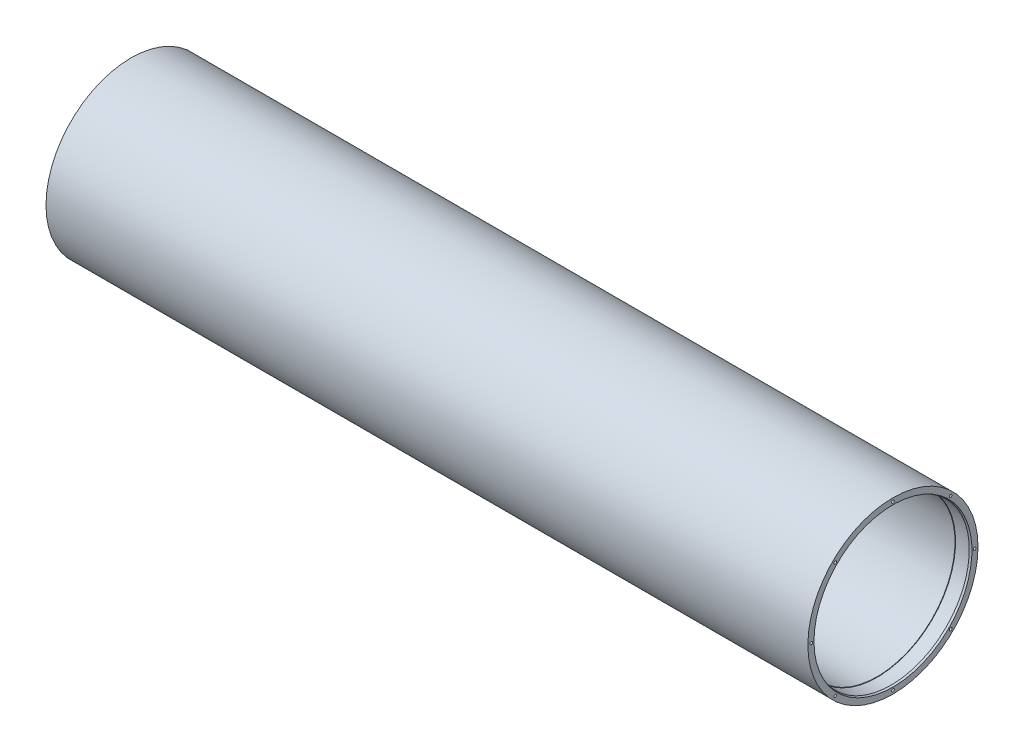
ISO-10303-21;
HEADER;
FILE_DESCRIPTION(('STEP AP214'),'2;1');
FILE_NAME('part.step','',(''),(''),'','','');
FILE_SCHEMA(('AUTOMOTIVE_DESIGN { 1 0 10303 214 1 1 1 1 }'));
ENDSEC;
DATA;
#1=APPLICATION_CONTEXT('core data for automotive mechanical design processes');
#2=APPLICATION_PROTOCOL_DEFINITION('international standard','automotive_design',2000,#1);
#3=PRODUCT_CONTEXT('',#1,'mechanical');
#4=PRODUCT('Part','Part','',(#3));
#5=PRODUCT_RELATED_PRODUCT_CATEGORY('part','',(#4));
#6=PRODUCT_DEFINITION_FORMATION('','',#4);
#7=PRODUCT_DEFINITION_CONTEXT('part definition',#1,'design');
#8=PRODUCT_DEFINITION('design','',#6,#7);
#9=PRODUCT_DEFINITION_SHAPE('','',#8);
#10=(LENGTH_UNIT() NAMED_UNIT(*) SI_UNIT(.MILLI.,.METRE.));
#11=(NAMED_UNIT(*) PLANE_ANGLE_UNIT() SI_UNIT($,.RADIAN.));
#12=(NAMED_UNIT(*) SI_UNIT($,.STERADIAN.) SOLID_ANGLE_UNIT());
#13=UNCERTAINTY_MEASURE_WITH_UNIT(LENGTH_MEASURE(1.E-05),#10,'distance_accuracy_value','');
#14=(GEOMETRIC_REPRESENTATION_CONTEXT(3) GLOBAL_UNCERTAINTY_ASSIGNED_CONTEXT((#13)) GLOBAL_UNIT_ASSIGNED_CONTEXT((#10,
#11,#12)) REPRESENTATION_CONTEXT('',''));
#15=CARTESIAN_POINT('',(0.,0.,0.));
#16=DIRECTION('',(0.,0.,1.));
#17=DIRECTION('',(1.,0.,0.));
#18=AXIS2_PLACEMENT_3D('',#15,#16,#17);
#19=CARTESIAN_POINT('',(4.67565707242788,0.,0.));
#20=DIRECTION('',(-1.,0.,0.));
#21=DIRECTION('',(0.,0.,1.));
#22=AXIS2_PLACEMENT_3D('',#19,#20,#21);
#23=CONICAL_SURFACE('',#22,190.5,0.349065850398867);
#24=CARTESIAN_POINT('',(0.,0.,0.));
#25=DIRECTION('',(-1.,0.,0.));
#26=DIRECTION('',(0.,0.,1.));
#27=AXIS2_PLACEMENT_3D('',#24,#25,#26);
#28=CIRCLE('',#27,192.2018);
#29=CARTESIAN_POINT('',(0.,0.,192.2018));
#30=VERTEX_POINT('',#29);
#31=EDGE_CURVE('E540',#30,#30,#28,.T.);
#32=ORIENTED_EDGE('',*,*,#31,.T.);
#33=EDGE_LOOP('',(#32));
#34=FACE_BOUND('',#33,.T.);
#35=CARTESIAN_POINT('',(4.67565707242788,0.,0.));
#36=DIRECTION('',(-1.,0.,0.));
#37=DIRECTION('',(0.,0.,1.));
#38=AXIS2_PLACEMENT_3D('',#35,#36,#37);
#39=CIRCLE('',#38,190.5);
#40=CARTESIAN_POINT('',(4.67565707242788,0.,190.5));
#41=VERTEX_POINT('',#40);
#42=EDGE_CURVE('E11',#41,#41,#39,.T.);
#43=ORIENTED_EDGE('',*,*,#42,.F.);
#44=EDGE_LOOP('',(#43));
#45=FACE_BOUND('',#44,.T.);
#46=ADVANCED_FACE('F380',(#34,#45),#23,.F.);
#47=CARTESIAN_POINT('',(0.,0.,0.));
#48=DIRECTION('',(-1.,0.,0.));
#49=DIRECTION('',(0.,0.,1.));
#50=AXIS2_PLACEMENT_3D('',#47,#48,#49);
#51=CYLINDRICAL_SURFACE('',#50,190.5);
#52=ORIENTED_EDGE('',*,*,#42,.T.);
#53=EDGE_LOOP('',(#52));
#54=FACE_BOUND('',#53,.T.);
#55=CARTESIAN_POINT('',(38.1,0.,0.));
#56=DIRECTION('',(-1.,0.,0.));
#57=DIRECTION('',(0.,0.,1.));
#58=AXIS2_PLACEMENT_3D('',#55,#56,#57);
#59=CIRCLE('',#58,190.5);
#60=CARTESIAN_POINT('',(38.1,0.,190.5));
#61=VERTEX_POINT('',#60);
#62=EDGE_CURVE('E387',#61,#61,#59,.T.);
#63=ORIENTED_EDGE('',*,*,#62,.F.);
#64=EDGE_LOOP('',(#63));
#65=FACE_BOUND('',#64,.T.);
#66=ADVANCED_FACE('F569',(#54,#65),#51,.F.);
#67=CARTESIAN_POINT('',(38.7350000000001,0.,0.));
#68=DIRECTION('',(-1.,0.,0.));
#69=DIRECTION('',(0.,0.,1.));
#70=AXIS2_PLACEMENT_3D('',#67,#68,#69);
#71=CONICAL_SURFACE('',#70,189.865,0.785398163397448);
#72=ORIENTED_EDGE('',*,*,#62,.T.);
#73=EDGE_LOOP('',(#72));
#74=FACE_BOUND('',#73,.T.);
#75=CARTESIAN_POINT('',(38.7350000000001,0.,0.));
#76=DIRECTION('',(-1.,0.,0.));
#77=DIRECTION('',(0.,0.,1.));
#78=AXIS2_PLACEMENT_3D('',#75,#76,#77);
#79=CIRCLE('',#78,189.865);
#80=CARTESIAN_POINT('',(38.7350000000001,0.,189.865));
#81=VERTEX_POINT('',#80);
#82=EDGE_CURVE('E561',#81,#81,#79,.T.);
#83=ORIENTED_EDGE('',*,*,#82,.F.);
#84=EDGE_LOOP('',(#83));
#85=FACE_BOUND('',#84,.T.);
#86=ADVANCED_FACE('F566',(#74,#85),#71,.F.);
#87=CARTESIAN_POINT('',(0.,0.,0.));
#88=DIRECTION('',(-1.,0.,0.));
#89=DIRECTION('',(0.,0.,1.));
#90=AXIS2_PLACEMENT_3D('',#87,#88,#89);
#91=CYLINDRICAL_SURFACE('',#90,189.865);
#92=ORIENTED_EDGE('',*,*,#82,.T.);
#93=EDGE_LOOP('',(#92));
#94=FACE_BOUND('',#93,.T.);
#95=CARTESIAN_POINT('',(1815.465,0.,0.));
#96=DIRECTION('',(-1.,0.,0.));
#97=DIRECTION('',(0.,0.,1.));
#98=AXIS2_PLACEMENT_3D('',#95,#96,#97);
#99=CIRCLE('',#98,189.865);
#100=CARTESIAN_POINT('',(1815.465,0.,189.865));
#101=VERTEX_POINT('',#100);
#102=EDGE_CURVE('E558',#101,#101,#99,.T.);
#103=ORIENTED_EDGE('',*,*,#102,.F.);
#104=EDGE_LOOP('',(#103));
#105=FACE_BOUND('',#104,.T.);
#106=ADVANCED_FACE('F576',(#94,#105),#91,.F.);
#107=CARTESIAN_POINT('',(1816.1,0.,0.));
#108=DIRECTION('',(1.,0.,0.));
#109=DIRECTION('',(0.,0.,-1.));
#110=AXIS2_PLACEMENT_3D('',#107,#108,#109);
#111=CONICAL_SURFACE('',#110,190.5,0.785398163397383);
#112=ORIENTED_EDGE('',*,*,#102,.T.);
#113=EDGE_LOOP('',(#112));
#114=FACE_BOUND('',#113,.T.);
#115=CARTESIAN_POINT('',(1816.1,0.,0.));
#116=DIRECTION('',(-1.,0.,0.));
#117=DIRECTION('',(0.,0.,1.));
#118=AXIS2_PLACEMENT_3D('',#115,#116,#117);
#119=CIRCLE('',#118,190.5);
#120=CARTESIAN_POINT('',(1816.1,0.,190.5));
#121=VERTEX_POINT('',#120);
#122=EDGE_CURVE('E555',#121,#121,#119,.T.);
#123=ORIENTED_EDGE('',*,*,#122,.F.);
#124=EDGE_LOOP('',(#123));
#125=FACE_BOUND('',#124,.T.);
#126=ADVANCED_FACE('F582',(#114,#125),#111,.F.);
#127=CARTESIAN_POINT('',(0.,0.,0.));
#128=DIRECTION('',(-1.,0.,0.));
#129=DIRECTION('',(0.,0.,1.));
#130=AXIS2_PLACEMENT_3D('',#127,#128,#129);
#131=CYLINDRICAL_SURFACE('',#130,190.5);
#132=ORIENTED_EDGE('',*,*,#122,.T.);
#133=EDGE_LOOP('',(#132));
#134=FACE_BOUND('',#133,.T.);
#135=CARTESIAN_POINT('',(1849.52434292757,0.,0.));
#136=DIRECTION('',(-1.,0.,0.));
#137=DIRECTION('',(0.,0.,1.));
#138=AXIS2_PLACEMENT_3D('',#135,#136,#137);
#139=CIRCLE('',#138,190.5);
#140=CARTESIAN_POINT('',(1849.52434292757,0.,190.5));
#141=VERTEX_POINT('',#140);
#142=EDGE_CURVE('E552',#141,#141,#139,.T.);
#143=ORIENTED_EDGE('',*,*,#142,.F.);
#144=EDGE_LOOP('',(#143));
#145=FACE_BOUND('',#144,.T.);
#146=ADVANCED_FACE('F586',(#134,#145),#131,.F.);
#147=CARTESIAN_POINT('',(1854.2,0.,0.));
#148=DIRECTION('',(1.,0.,0.));
#149=DIRECTION('',(0.,0.,-1.));
#150=AXIS2_PLACEMENT_3D('',#147,#148,#149);
#151=CONICAL_SURFACE('',#150,192.2018,0.349065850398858);
#152=ORIENTED_EDGE('',*,*,#142,.T.);
#153=EDGE_LOOP('',(#152));
#154=FACE_BOUND('',#153,.T.);
#155=CARTESIAN_POINT('',(1854.2,0.,0.));
#156=DIRECTION('',(-1.,0.,0.));
#157=DIRECTION('',(0.,0.,1.));
#158=AXIS2_PLACEMENT_3D('',#155,#156,#157);
#159=CIRCLE('',#158,192.2018);
#160=CARTESIAN_POINT('',(1854.2,0.,192.2018));
#161=VERTEX_POINT('',#160);
#162=EDGE_CURVE('E549',#161,#161,#159,.T.);
#163=ORIENTED_EDGE('',*,*,#162,.F.);
#164=EDGE_LOOP('',(#163));
#165=FACE_BOUND('',#164,.T.);
#166=ADVANCED_FACE('F590',(#154,#165),#151,.F.);
#167=CARTESIAN_POINT('',(1854.2,-192.2018,0.));
#168=DIRECTION('',(1.,0.,0.));
#169=DIRECTION('',(0.,0.,-1.));
#170=AXIS2_PLACEMENT_3D('',#167,#168,#169);
#171=PLANE('',#170);
#172=CARTESIAN_POINT('',(1854.2,140.541008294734,-140.541008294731));
#173=DIRECTION('',(1.,0.,0.));
#174=DIRECTION('',(0.,0.,-1.));
#175=AXIS2_PLACEMENT_3D('',#172,#173,#174);
#176=CIRCLE('',#175,3.26389999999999);
#177=CARTESIAN_POINT('',(1854.2,140.541008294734,-143.804908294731));
#178=VERTEX_POINT('',#177);
#179=EDGE_CURVE('E445',#178,#178,#176,.T.);
#180=ORIENTED_EDGE('',*,*,#179,.F.);
#181=EDGE_LOOP('',(#180));
#182=FACE_BOUND('',#181,.T.);
#183=CARTESIAN_POINT('',(1854.2,2.08184932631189E-12,-198.755));
#184=DIRECTION('',(1.,0.,0.));
#185=DIRECTION('',(0.,0.,-1.));
#186=AXIS2_PLACEMENT_3D('',#183,#184,#185);
#187=CIRCLE('',#186,3.2639);
#188=CARTESIAN_POINT('',(1854.2,2.08184932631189E-12,-202.0189));
#189=VERTEX_POINT('',#188);
#190=EDGE_CURVE('E453',#189,#189,#187,.T.);
#191=ORIENTED_EDGE('',*,*,#190,.F.);
#192=EDGE_LOOP('',(#191));
#193=FACE_BOUND('',#192,.T.);
#194=CARTESIAN_POINT('',(1854.2,-140.541008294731,-140.541008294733));
#195=DIRECTION('',(1.,0.,0.));
#196=DIRECTION('',(0.,0.,-1.));
#197=AXIS2_PLACEMENT_3D('',#194,#195,#196);
#198=CIRCLE('',#197,3.26389999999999);
#199=CARTESIAN_POINT('',(1854.2,-140.541008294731,-143.804908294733));
#200=VERTEX_POINT('',#199);
#201=EDGE_CURVE('E459',#200,#200,#198,.T.);
#202=ORIENTED_EDGE('',*,*,#201,.F.);
#203=EDGE_LOOP('',(#202));
#204=FACE_BOUND('',#203,.T.);
#205=CARTESIAN_POINT('',(1854.2,-198.755,-1.38789955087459E-12));
#206=DIRECTION('',(1.,0.,0.));
#207=DIRECTION('',(0.,0.,-1.));
#208=AXIS2_PLACEMENT_3D('',#205,#206,#207);
#209=CIRCLE('',#208,3.26389999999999);
#210=CARTESIAN_POINT('',(1854.2,-198.755,-3.26390000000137));
#211=VERTEX_POINT('',#210);
#212=EDGE_CURVE('E465',#211,#211,#209,.T.);
#213=ORIENTED_EDGE('',*,*,#212,.F.);
#214=EDGE_LOOP('',(#213));
#215=FACE_BOUND('',#214,.T.);
#216=CARTESIAN_POINT('',(1854.2,-140.541008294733,140.541008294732));
#217=DIRECTION('',(1.,0.,0.));
#218=DIRECTION('',(0.,0.,-1.));
#219=AXIS2_PLACEMENT_3D('',#216,#217,#218);
#220=CIRCLE('',#219,3.26389999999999);
#221=CARTESIAN_POINT('',(1854.2,-140.541008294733,137.277108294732));
#222=VERTEX_POINT('',#221);
#223=EDGE_CURVE('E471',#222,#222,#220,.T.);
#224=ORIENTED_EDGE('',*,*,#223,.F.);
#225=EDGE_LOOP('',(#224));
#226=FACE_BOUND('',#225,.T.);
#227=CARTESIAN_POINT('',(1854.2,-6.93949775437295E-13,198.755));
#228=DIRECTION('',(1.,0.,0.));
#229=DIRECTION('',(0.,0.,-1.));
#230=AXIS2_PLACEMENT_3D('',#227,#228,#229);
#231=CIRCLE('',#230,3.2639);
#232=CARTESIAN_POINT('',(1854.2,-6.93949775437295E-13,195.4911));
#233=VERTEX_POINT('',#232);
#234=EDGE_CURVE('E477',#233,#233,#231,.T.);
#235=ORIENTED_EDGE('',*,*,#234,.F.);
#236=EDGE_LOOP('',(#235));
#237=FACE_BOUND('',#236,.T.);
#238=CARTESIAN_POINT('',(1854.2,140.541008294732,140.541008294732));
#239=DIRECTION('',(1.,0.,0.));
#240=DIRECTION('',(0.,0.,-1.));
#241=AXIS2_PLACEMENT_3D('',#238,#239,#240);
#242=CIRCLE('',#241,3.26389999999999);
#243=CARTESIAN_POINT('',(1854.2,140.541008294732,137.277108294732));
#244=VERTEX_POINT('',#243);
#245=EDGE_CURVE('E483',#244,#244,#242,.T.);
#246=ORIENTED_EDGE('',*,*,#245,.F.);
#247=EDGE_LOOP('',(#246));
#248=FACE_BOUND('',#247,.T.);
#249=CARTESIAN_POINT('',(1854.2,198.755,0.));
#250=DIRECTION('',(1.,0.,0.));
#251=DIRECTION('',(0.,0.,-1.));
#252=AXIS2_PLACEMENT_3D('',#249,#250,#251);
#253=CIRCLE('',#252,3.26389999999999);
#254=CARTESIAN_POINT('',(1854.2,198.755,-3.26389999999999));
#255=VERTEX_POINT('',#254);
#256=EDGE_CURVE('E489',#255,#255,#253,.T.);
#257=ORIENTED_EDGE('',*,*,#256,.F.);
#258=EDGE_LOOP('',(#257));
#259=FACE_BOUND('',#258,.T.);
#260=ORIENTED_EDGE('',*,*,#162,.T.);
#261=EDGE_LOOP('',(#260));
#262=FACE_BOUND('',#261,.T.);
#263=CARTESIAN_POINT('',(1854.2,0.,0.));
#264=DIRECTION('',(-1.,0.,0.));
#265=DIRECTION('',(0.,0.,1.));
#266=AXIS2_PLACEMENT_3D('',#263,#264,#265);
#267=CIRCLE('',#266,207.01);
#268=CARTESIAN_POINT('',(1854.2,0.,207.01));
#269=VERTEX_POINT('',#268);
#270=EDGE_CURVE('E546',#269,#269,#267,.T.);
#271=ORIENTED_EDGE('',*,*,#270,.F.);
#272=EDGE_LOOP('',(#271));
#273=FACE_BOUND('',#272,.T.);
#274=ADVANCED_FACE('F594',(#182,#193,#204,#215,#226,#237,#248,#259,#262,#273),#171,.T.);
#275=CARTESIAN_POINT('',(0.,0.,0.));
#276=DIRECTION('',(-1.,0.,0.));
#277=DIRECTION('',(0.,0.,1.));
#278=AXIS2_PLACEMENT_3D('',#275,#276,#277);
#279=CYLINDRICAL_SURFACE('',#278,207.01);
#280=ORIENTED_EDGE('',*,*,#270,.T.);
#281=EDGE_LOOP('',(#280));
#282=FACE_BOUND('',#281,.T.);
#283=CARTESIAN_POINT('',(0.,0.,0.));
#284=DIRECTION('',(-1.,0.,0.));
#285=DIRECTION('',(0.,0.,1.));
#286=AXIS2_PLACEMENT_3D('',#283,#284,#285);
#287=CIRCLE('',#286,207.01);
#288=CARTESIAN_POINT('',(0.,0.,207.01));
#289=VERTEX_POINT('',#288);
#290=EDGE_CURVE('E543',#289,#289,#287,.T.);
#291=ORIENTED_EDGE('',*,*,#290,.F.);
#292=EDGE_LOOP('',(#291));
#293=FACE_BOUND('',#292,.T.);
#294=ADVANCED_FACE('F598',(#282,#293),#279,.T.);
#295=CARTESIAN_POINT('',(0.,-192.2018,0.));
#296=DIRECTION('',(-1.,0.,0.));
#297=DIRECTION('',(0.,0.,1.));
#298=AXIS2_PLACEMENT_3D('',#295,#296,#297);
#299=PLANE('',#298);
#300=CARTESIAN_POINT('',(0.,140.541008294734,-140.541008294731));
#301=DIRECTION('',(-1.,0.,0.));
#302=DIRECTION('',(0.,0.,1.));
#303=AXIS2_PLACEMENT_3D('',#300,#301,#302);
#304=CIRCLE('',#303,3.26389999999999);
#305=CARTESIAN_POINT('',(0.,140.541008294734,-137.277108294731));
#306=VERTEX_POINT('',#305);
#307=EDGE_CURVE('E495',#306,#306,#304,.T.);
#308=ORIENTED_EDGE('',*,*,#307,.F.);
#309=EDGE_LOOP('',(#308));
#310=FACE_BOUND('',#309,.T.);
#311=CARTESIAN_POINT('',(0.,2.08184932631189E-12,-198.755));
#312=DIRECTION('',(-1.,0.,0.));
#313=DIRECTION('',(0.,0.,1.));
#314=AXIS2_PLACEMENT_3D('',#311,#312,#313);
#315=CIRCLE('',#314,3.2639);
#316=CARTESIAN_POINT('',(0.,2.08184932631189E-12,-195.4911));
#317=VERTEX_POINT('',#316);
#318=EDGE_CURVE('E501',#317,#317,#315,.T.);
#319=ORIENTED_EDGE('',*,*,#318,.F.);
#320=EDGE_LOOP('',(#319));
#321=FACE_BOUND('',#320,.T.);
#322=CARTESIAN_POINT('',(0.,-140.541008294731,-140.541008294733));
#323=DIRECTION('',(-1.,0.,0.));
#324=DIRECTION('',(0.,0.,1.));
#325=AXIS2_PLACEMENT_3D('',#322,#323,#324);
#326=CIRCLE('',#325,3.26389999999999);
#327=CARTESIAN_POINT('',(0.,-140.541008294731,-137.277108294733));
#328=VERTEX_POINT('',#327);
#329=EDGE_CURVE('E507',#328,#328,#326,.T.);
#330=ORIENTED_EDGE('',*,*,#329,.F.);
#331=EDGE_LOOP('',(#330));
#332=FACE_BOUND('',#331,.T.);
#333=CARTESIAN_POINT('',(0.,-198.755,-1.38789955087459E-12));
#334=DIRECTION('',(-1.,0.,0.));
#335=DIRECTION('',(0.,0.,1.));
#336=AXIS2_PLACEMENT_3D('',#333,#334,#335);
#337=CIRCLE('',#336,3.26389999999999);
#338=CARTESIAN_POINT('',(0.,-198.755,3.2638999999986));
#339=VERTEX_POINT('',#338);
#340=EDGE_CURVE('E513',#339,#339,#337,.T.);
#341=ORIENTED_EDGE('',*,*,#340,.F.);
#342=EDGE_LOOP('',(#341));
#343=FACE_BOUND('',#342,.T.);
#344=CARTESIAN_POINT('',(0.,-140.541008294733,140.541008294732));
#345=DIRECTION('',(-1.,0.,0.));
#346=DIRECTION('',(0.,0.,1.));
#347=AXIS2_PLACEMENT_3D('',#344,#345,#346);
#348=CIRCLE('',#347,3.26389999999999);
#349=CARTESIAN_POINT('',(0.,-140.541008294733,143.804908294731));
#350=VERTEX_POINT('',#349);
#351=EDGE_CURVE('E519',#350,#350,#348,.T.);
#352=ORIENTED_EDGE('',*,*,#351,.F.);
#353=EDGE_LOOP('',(#352));
#354=FACE_BOUND('',#353,.T.);
#355=CARTESIAN_POINT('',(0.,-6.93949775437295E-13,198.755));
#356=DIRECTION('',(-1.,0.,0.));
#357=DIRECTION('',(0.,0.,1.));
#358=AXIS2_PLACEMENT_3D('',#355,#356,#357);
#359=CIRCLE('',#358,3.2639);
#360=CARTESIAN_POINT('',(0.,-6.93949775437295E-13,202.0189));
#361=VERTEX_POINT('',#360);
#362=EDGE_CURVE('E525',#361,#361,#359,.T.);
#363=ORIENTED_EDGE('',*,*,#362,.F.);
#364=EDGE_LOOP('',(#363));
#365=FACE_BOUND('',#364,.T.);
#366=CARTESIAN_POINT('',(0.,140.541008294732,140.541008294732));
#367=DIRECTION('',(-1.,0.,0.));
#368=DIRECTION('',(0.,0.,1.));
#369=AXIS2_PLACEMENT_3D('',#366,#367,#368);
#370=CIRCLE('',#369,3.26389999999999);
#371=CARTESIAN_POINT('',(0.,140.541008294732,143.804908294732));
#372=VERTEX_POINT('',#371);
#373=EDGE_CURVE('E531',#372,#372,#370,.T.);
#374=ORIENTED_EDGE('',*,*,#373,.F.);
#375=EDGE_LOOP('',(#374));
#376=FACE_BOUND('',#375,.T.);
#377=CARTESIAN_POINT('',(0.,198.755,0.));
#378=DIRECTION('',(-1.,0.,0.));
#379=DIRECTION('',(0.,0.,1.));
#380=AXIS2_PLACEMENT_3D('',#377,#378,#379);
#381=CIRCLE('',#380,3.26389999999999);
#382=CARTESIAN_POINT('',(0.,198.755,3.26389999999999));
#383=VERTEX_POINT('',#382);
#384=EDGE_CURVE('E537',#383,#383,#381,.T.);
#385=ORIENTED_EDGE('',*,*,#384,.F.);
#386=EDGE_LOOP('',(#385));
#387=FACE_BOUND('',#386,.T.);
#388=ORIENTED_EDGE('',*,*,#290,.T.);
#389=EDGE_LOOP('',(#388));
#390=FACE_BOUND('',#389,.T.);
#391=ORIENTED_EDGE('',*,*,#31,.F.);
#392=EDGE_LOOP('',(#391));
#393=FACE_BOUND('',#392,.T.);
#394=ADVANCED_FACE('F602',(#310,#321,#332,#343,#354,#365,#376,#387,#390,#393),#299,.T.);
#395=CARTESIAN_POINT('',(0.,198.755,0.));
#396=DIRECTION('',(-1.,0.,0.));
#397=DIRECTION('',(0.,0.,1.));
#398=AXIS2_PLACEMENT_3D('',#395,#396,#397);
#399=CYLINDRICAL_SURFACE('',#398,3.26389999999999);
#400=CARTESIAN_POINT('',(26.924,198.755,0.));
#401=DIRECTION('',(-1.,0.,0.));
#402=DIRECTION('',(0.,0.,1.));
#403=AXIS2_PLACEMENT_3D('',#400,#401,#402);
#404=CIRCLE('',#403,3.26389999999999);
#405=CARTESIAN_POINT('',(26.924,198.755,3.26389999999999));
#406=VERTEX_POINT('',#405);
#407=EDGE_CURVE('E534',#406,#406,#404,.T.);
#408=ORIENTED_EDGE('',*,*,#407,.F.);
#409=EDGE_LOOP('',(#408));
#410=FACE_BOUND('',#409,.T.);
#411=ORIENTED_EDGE('',*,*,#384,.T.);
#412=EDGE_LOOP('',(#411));
#413=FACE_BOUND('',#412,.T.);
#414=ADVANCED_FACE('F606',(#410,#413),#399,.F.);
#415=CARTESIAN_POINT('',(26.924,198.755,0.));
#416=DIRECTION('',(-1.,0.,0.));
#417=DIRECTION('',(0.,0.,1.));
#418=AXIS2_PLACEMENT_3D('',#415,#416,#417);
#419=CONICAL_SURFACE('',#418,3.26389999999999,1.02974425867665);
#420=CARTESIAN_POINT('',(28.8851489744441,198.755,0.));
#421=VERTEX_POINT('',#420);
#422=VERTEX_LOOP('',#421);
#423=FACE_BOUND('',#422,.T.);
#424=ORIENTED_EDGE('',*,*,#407,.T.);
#425=EDGE_LOOP('',(#424));
#426=FACE_BOUND('',#425,.T.);
#427=ADVANCED_FACE('F610',(#423,#426),#419,.F.);
#428=CARTESIAN_POINT('',(0.,140.541008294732,140.541008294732));
#429=DIRECTION('',(-1.,0.,0.));
#430=DIRECTION('',(0.,0.,1.));
#431=AXIS2_PLACEMENT_3D('',#428,#429,#430);
#432=CYLINDRICAL_SURFACE('',#431,3.26389999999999);
#433=CARTESIAN_POINT('',(26.924,140.541008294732,140.541008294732));
#434=DIRECTION('',(-1.,0.,0.));
#435=DIRECTION('',(0.,0.,1.));
#436=AXIS2_PLACEMENT_3D('',#433,#434,#435);
#437=CIRCLE('',#436,3.26389999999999);
#438=CARTESIAN_POINT('',(26.924,140.541008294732,143.804908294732));
#439=VERTEX_POINT('',#438);
#440=EDGE_CURVE('E528',#439,#439,#437,.T.);
#441=ORIENTED_EDGE('',*,*,#440,.F.);
#442=EDGE_LOOP('',(#441));
#443=FACE_BOUND('',#442,.T.);
#444=ORIENTED_EDGE('',*,*,#373,.T.);
#445=EDGE_LOOP('',(#444));
#446=FACE_BOUND('',#445,.T.);
#447=ADVANCED_FACE('F614',(#443,#446),#432,.F.);
#448=CARTESIAN_POINT('',(26.924,140.541008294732,140.541008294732));
#449=DIRECTION('',(-1.,0.,0.));
#450=DIRECTION('',(0.,0.,1.));
#451=AXIS2_PLACEMENT_3D('',#448,#449,#450);
#452=CONICAL_SURFACE('',#451,3.26389999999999,1.02974425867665);
#453=CARTESIAN_POINT('',(28.8851489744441,140.541008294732,140.541008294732));
#454=VERTEX_POINT('',#453);
#455=VERTEX_LOOP('',#454);
#456=FACE_BOUND('',#455,.T.);
#457=ORIENTED_EDGE('',*,*,#440,.T.);
#458=EDGE_LOOP('',(#457));
#459=FACE_BOUND('',#458,.T.);
#460=ADVANCED_FACE('F617',(#456,#459),#452,.F.);
#461=CARTESIAN_POINT('',(0.,-6.93949775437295E-13,198.755));
#462=DIRECTION('',(-1.,0.,0.));
#463=DIRECTION('',(0.,0.,1.));
#464=AXIS2_PLACEMENT_3D('',#461,#462,#463);
#465=CYLINDRICAL_SURFACE('',#464,3.2639);
#466=CARTESIAN_POINT('',(26.924,-6.93949775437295E-13,198.755));
#467=DIRECTION('',(-1.,0.,0.));
#468=DIRECTION('',(0.,0.,1.));
#469=AXIS2_PLACEMENT_3D('',#466,#467,#468);
#470=CIRCLE('',#469,3.26389999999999);
#471=CARTESIAN_POINT('',(26.924,-6.93949775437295E-13,202.0189));
#472=VERTEX_POINT('',#471);
#473=EDGE_CURVE('E522',#472,#472,#470,.T.);
#474=ORIENTED_EDGE('',*,*,#473,.F.);
#475=EDGE_LOOP('',(#474));
#476=FACE_BOUND('',#475,.T.);
#477=ORIENTED_EDGE('',*,*,#362,.T.);
#478=EDGE_LOOP('',(#477));
#479=FACE_BOUND('',#478,.T.);
#480=ADVANCED_FACE('F621',(#476,#479),#465,.F.);
#481=CARTESIAN_POINT('',(26.924,-6.93949775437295E-13,198.755));
#482=DIRECTION('',(-1.,0.,0.));
#483=DIRECTION('',(0.,0.,1.));
#484=AXIS2_PLACEMENT_3D('',#481,#482,#483);
#485=CONICAL_SURFACE('',#484,3.26389999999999,1.02974425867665);
#486=CARTESIAN_POINT('',(28.8851489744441,-7.00977971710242E-13,198.755));
#487=VERTEX_POINT('',#486);
#488=VERTEX_LOOP('',#487);
#489=FACE_BOUND('',#488,.T.);
#490=ORIENTED_EDGE('',*,*,#473,.T.);
#491=EDGE_LOOP('',(#490));
#492=FACE_BOUND('',#491,.T.);
#493=ADVANCED_FACE('F624',(#489,#492),#485,.F.);
#494=CARTESIAN_POINT('',(0.,-140.541008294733,140.541008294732));
#495=DIRECTION('',(-1.,0.,0.));
#496=DIRECTION('',(0.,0.,1.));
#497=AXIS2_PLACEMENT_3D('',#494,#495,#496);
#498=CYLINDRICAL_SURFACE('',#497,3.26389999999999);
#499=CARTESIAN_POINT('',(26.924,-140.541008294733,140.541008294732));
#500=DIRECTION('',(-1.,0.,0.));
#501=DIRECTION('',(0.,0.,1.));
#502=AXIS2_PLACEMENT_3D('',#499,#500,#501);
#503=CIRCLE('',#502,3.26389999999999);
#504=CARTESIAN_POINT('',(26.924,-140.541008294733,143.804908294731));
#505=VERTEX_POINT('',#504);
#506=EDGE_CURVE('E516',#505,#505,#503,.T.);
#507=ORIENTED_EDGE('',*,*,#506,.F.);
#508=EDGE_LOOP('',(#507));
#509=FACE_BOUND('',#508,.T.);
#510=ORIENTED_EDGE('',*,*,#351,.T.);
#511=EDGE_LOOP('',(#510));
#512=FACE_BOUND('',#511,.T.);
#513=ADVANCED_FACE('F628',(#509,#512),#498,.F.);
#514=CARTESIAN_POINT('',(26.924,-140.541008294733,140.541008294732));
#515=DIRECTION('',(-1.,0.,0.));
#516=DIRECTION('',(0.,0.,1.));
#517=AXIS2_PLACEMENT_3D('',#514,#515,#516);
#518=CONICAL_SURFACE('',#517,3.26389999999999,1.02974425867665);
#519=CARTESIAN_POINT('',(28.8851489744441,-140.541008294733,140.541008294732));
#520=VERTEX_POINT('',#519);
#521=VERTEX_LOOP('',#520);
#522=FACE_BOUND('',#521,.T.);
#523=ORIENTED_EDGE('',*,*,#506,.T.);
#524=EDGE_LOOP('',(#523));
#525=FACE_BOUND('',#524,.T.);
#526=ADVANCED_FACE('F632',(#522,#525),#518,.F.);
#527=CARTESIAN_POINT('',(0.,-198.755,-1.38789955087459E-12));
#528=DIRECTION('',(-1.,0.,0.));
#529=DIRECTION('',(0.,0.,1.));
#530=AXIS2_PLACEMENT_3D('',#527,#528,#529);
#531=CYLINDRICAL_SURFACE('',#530,3.26389999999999);
#532=CARTESIAN_POINT('',(26.924,-198.755,-1.38789955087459E-12));
#533=DIRECTION('',(-1.,0.,0.));
#534=DIRECTION('',(0.,0.,1.));
#535=AXIS2_PLACEMENT_3D('',#532,#533,#534);
#536=CIRCLE('',#535,3.26389999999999);
#537=CARTESIAN_POINT('',(26.924,-198.755,3.2638999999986));
#538=VERTEX_POINT('',#537);
#539=EDGE_CURVE('E510',#538,#538,#536,.T.);
#540=ORIENTED_EDGE('',*,*,#539,.F.);
#541=EDGE_LOOP('',(#540));
#542=FACE_BOUND('',#541,.T.);
#543=ORIENTED_EDGE('',*,*,#340,.T.);
#544=EDGE_LOOP('',(#543));
#545=FACE_BOUND('',#544,.T.);
#546=ADVANCED_FACE('F636',(#542,#545),#531,.F.);
#547=CARTESIAN_POINT('',(26.924,-198.755,-1.38789955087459E-12));
#548=DIRECTION('',(-1.,0.,0.));
#549=DIRECTION('',(0.,0.,1.));
#550=AXIS2_PLACEMENT_3D('',#547,#548,#549);
#551=CONICAL_SURFACE('',#550,3.26389999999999,1.02974425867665);
#552=CARTESIAN_POINT('',(28.8851489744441,-198.755,-1.38789955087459E-12));
#553=VERTEX_POINT('',#552);
#554=VERTEX_LOOP('',#553);
#555=FACE_BOUND('',#554,.T.);
#556=ORIENTED_EDGE('',*,*,#539,.T.);
#557=EDGE_LOOP('',(#556));
#558=FACE_BOUND('',#557,.T.);
#559=ADVANCED_FACE('F640',(#555,#558),#551,.F.);
#560=CARTESIAN_POINT('',(0.,-140.541008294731,-140.541008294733));
#561=DIRECTION('',(-1.,0.,0.));
#562=DIRECTION('',(0.,0.,1.));
#563=AXIS2_PLACEMENT_3D('',#560,#561,#562);
#564=CYLINDRICAL_SURFACE('',#563,3.26389999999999);
#565=CARTESIAN_POINT('',(26.924,-140.541008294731,-140.541008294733));
#566=DIRECTION('',(-1.,0.,0.));
#567=DIRECTION('',(0.,0.,1.));
#568=AXIS2_PLACEMENT_3D('',#565,#566,#567);
#569=CIRCLE('',#568,3.26389999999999);
#570=CARTESIAN_POINT('',(26.924,-140.541008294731,-137.277108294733));
#571=VERTEX_POINT('',#570);
#572=EDGE_CURVE('E504',#571,#571,#569,.T.);
#573=ORIENTED_EDGE('',*,*,#572,.F.);
#574=EDGE_LOOP('',(#573));
#575=FACE_BOUND('',#574,.T.);
#576=ORIENTED_EDGE('',*,*,#329,.T.);
#577=EDGE_LOOP('',(#576));
#578=FACE_BOUND('',#577,.T.);
#579=ADVANCED_FACE('F644',(#575,#578),#564,.F.);
#580=CARTESIAN_POINT('',(26.924,-140.541008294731,-140.541008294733));
#581=DIRECTION('',(-1.,0.,0.));
#582=DIRECTION('',(0.,0.,1.));
#583=AXIS2_PLACEMENT_3D('',#580,#581,#582);
#584=CONICAL_SURFACE('',#583,3.26389999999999,1.02974425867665);
#585=CARTESIAN_POINT('',(28.8851489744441,-140.541008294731,-140.541008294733));
#586=VERTEX_POINT('',#585);
#587=VERTEX_LOOP('',#586);
#588=FACE_BOUND('',#587,.T.);
#589=ORIENTED_EDGE('',*,*,#572,.T.);
#590=EDGE_LOOP('',(#589));
#591=FACE_BOUND('',#590,.T.);
#592=ADVANCED_FACE('F648',(#588,#591),#584,.F.);
#593=CARTESIAN_POINT('',(0.,2.08184932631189E-12,-198.755));
#594=DIRECTION('',(-1.,0.,0.));
#595=DIRECTION('',(0.,0.,1.));
#596=AXIS2_PLACEMENT_3D('',#593,#594,#595);
#597=CYLINDRICAL_SURFACE('',#596,3.2639);
#598=CARTESIAN_POINT('',(26.924,2.08184932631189E-12,-198.755));
#599=DIRECTION('',(-1.,0.,0.));
#600=DIRECTION('',(0.,0.,1.));
#601=AXIS2_PLACEMENT_3D('',#598,#599,#600);
#602=CIRCLE('',#601,3.26389999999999);
#603=CARTESIAN_POINT('',(26.924,2.08184932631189E-12,-195.4911));
#604=VERTEX_POINT('',#603);
#605=EDGE_CURVE('E498',#604,#604,#602,.T.);
#606=ORIENTED_EDGE('',*,*,#605,.F.);
#607=EDGE_LOOP('',(#606));
#608=FACE_BOUND('',#607,.T.);
#609=ORIENTED_EDGE('',*,*,#318,.T.);
#610=EDGE_LOOP('',(#609));
#611=FACE_BOUND('',#610,.T.);
#612=ADVANCED_FACE('F652',(#608,#611),#597,.F.);
#613=CARTESIAN_POINT('',(26.924,2.08184932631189E-12,-198.755));
#614=DIRECTION('',(-1.,0.,0.));
#615=DIRECTION('',(0.,0.,1.));
#616=AXIS2_PLACEMENT_3D('',#613,#614,#615);
#617=CONICAL_SURFACE('',#616,3.26389999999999,1.02974425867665);
#618=CARTESIAN_POINT('',(28.8851489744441,2.07482113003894E-12,-198.755));
#619=VERTEX_POINT('',#618);
#620=VERTEX_LOOP('',#619);
#621=FACE_BOUND('',#620,.T.);
#622=ORIENTED_EDGE('',*,*,#605,.T.);
#623=EDGE_LOOP('',(#622));
#624=FACE_BOUND('',#623,.T.);
#625=ADVANCED_FACE('F656',(#621,#624),#617,.F.);
#626=CARTESIAN_POINT('',(0.,140.541008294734,-140.541008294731));
#627=DIRECTION('',(-1.,0.,0.));
#628=DIRECTION('',(0.,0.,1.));
#629=AXIS2_PLACEMENT_3D('',#626,#627,#628);
#630=CYLINDRICAL_SURFACE('',#629,3.26389999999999);
#631=CARTESIAN_POINT('',(26.924,140.541008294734,-140.541008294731));
#632=DIRECTION('',(-1.,0.,0.));
#633=DIRECTION('',(0.,0.,1.));
#634=AXIS2_PLACEMENT_3D('',#631,#632,#633);
#635=CIRCLE('',#634,3.26389999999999);
#636=CARTESIAN_POINT('',(26.924,140.541008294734,-137.277108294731));
#637=VERTEX_POINT('',#636);
#638=EDGE_CURVE('E492',#637,#637,#635,.T.);
#639=ORIENTED_EDGE('',*,*,#638,.F.);
#640=EDGE_LOOP('',(#639));
#641=FACE_BOUND('',#640,.T.);
#642=ORIENTED_EDGE('',*,*,#307,.T.);
#643=EDGE_LOOP('',(#642));
#644=FACE_BOUND('',#643,.T.);
#645=ADVANCED_FACE('F660',(#641,#644),#630,.F.);
#646=CARTESIAN_POINT('',(26.924,140.541008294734,-140.541008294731));
#647=DIRECTION('',(-1.,0.,0.));
#648=DIRECTION('',(0.,0.,1.));
#649=AXIS2_PLACEMENT_3D('',#646,#647,#648);
#650=CONICAL_SURFACE('',#649,3.26389999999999,1.02974425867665);
#651=CARTESIAN_POINT('',(28.8851489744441,140.541008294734,-140.541008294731));
#652=VERTEX_POINT('',#651);
#653=VERTEX_LOOP('',#652);
#654=FACE_BOUND('',#653,.T.);
#655=ORIENTED_EDGE('',*,*,#638,.T.);
#656=EDGE_LOOP('',(#655));
#657=FACE_BOUND('',#656,.T.);
#658=ADVANCED_FACE('F664',(#654,#657),#650,.F.);
#659=CARTESIAN_POINT('',(1854.2,198.755,0.));
#660=DIRECTION('',(1.,0.,0.));
#661=DIRECTION('',(0.,0.,-1.));
#662=AXIS2_PLACEMENT_3D('',#659,#660,#661);
#663=CYLINDRICAL_SURFACE('',#662,3.26389999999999);
#664=CARTESIAN_POINT('',(1827.276,198.755,0.));
#665=DIRECTION('',(1.,0.,0.));
#666=DIRECTION('',(0.,0.,-1.));
#667=AXIS2_PLACEMENT_3D('',#664,#665,#666);
#668=CIRCLE('',#667,3.26389999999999);
#669=CARTESIAN_POINT('',(1827.276,198.755,-3.26389999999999));
#670=VERTEX_POINT('',#669);
#671=EDGE_CURVE('E486',#670,#670,#668,.T.);
#672=ORIENTED_EDGE('',*,*,#671,.F.);
#673=EDGE_LOOP('',(#672));
#674=FACE_BOUND('',#673,.T.);
#675=ORIENTED_EDGE('',*,*,#256,.T.);
#676=EDGE_LOOP('',(#675));
#677=FACE_BOUND('',#676,.T.);
#678=ADVANCED_FACE('F668',(#674,#677),#663,.F.);
#679=CARTESIAN_POINT('',(1827.276,198.755,0.));
#680=DIRECTION('',(1.,0.,0.));
#681=DIRECTION('',(0.,0.,-1.));
#682=AXIS2_PLACEMENT_3D('',#679,#680,#681);
#683=CONICAL_SURFACE('',#682,3.26389999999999,1.02974425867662);
#684=CARTESIAN_POINT('',(1825.31485102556,198.755,0.));
#685=VERTEX_POINT('',#684);
#686=VERTEX_LOOP('',#685);
#687=FACE_BOUND('',#686,.T.);
#688=ORIENTED_EDGE('',*,*,#671,.T.);
#689=EDGE_LOOP('',(#688));
#690=FACE_BOUND('',#689,.T.);
#691=ADVANCED_FACE('F672',(#687,#690),#683,.F.);
#692=CARTESIAN_POINT('',(1854.2,140.541008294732,140.541008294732));
#693=DIRECTION('',(1.,0.,0.));
#694=DIRECTION('',(0.,0.,-1.));
#695=AXIS2_PLACEMENT_3D('',#692,#693,#694);
#696=CYLINDRICAL_SURFACE('',#695,3.26389999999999);
#697=CARTESIAN_POINT('',(1827.276,140.541008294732,140.541008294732));
#698=DIRECTION('',(1.,0.,0.));
#699=DIRECTION('',(0.,0.,-1.));
#700=AXIS2_PLACEMENT_3D('',#697,#698,#699);
#701=CIRCLE('',#700,3.26389999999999);
#702=CARTESIAN_POINT('',(1827.276,140.541008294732,137.277108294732));
#703=VERTEX_POINT('',#702);
#704=EDGE_CURVE('E480',#703,#703,#701,.T.);
#705=ORIENTED_EDGE('',*,*,#704,.F.);
#706=EDGE_LOOP('',(#705));
#707=FACE_BOUND('',#706,.T.);
#708=ORIENTED_EDGE('',*,*,#245,.T.);
#709=EDGE_LOOP('',(#708));
#710=FACE_BOUND('',#709,.T.);
#711=ADVANCED_FACE('F676',(#707,#710),#696,.F.);
#712=CARTESIAN_POINT('',(1827.276,140.541008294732,140.541008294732));
#713=DIRECTION('',(1.,0.,0.));
#714=DIRECTION('',(0.,0.,-1.));
#715=AXIS2_PLACEMENT_3D('',#712,#713,#714);
#716=CONICAL_SURFACE('',#715,3.26389999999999,1.02974425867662);
#717=CARTESIAN_POINT('',(1825.31485102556,140.541008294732,140.541008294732));
#718=VERTEX_POINT('',#717);
#719=VERTEX_LOOP('',#718);
#720=FACE_BOUND('',#719,.T.);
#721=ORIENTED_EDGE('',*,*,#704,.T.);
#722=EDGE_LOOP('',(#721));
#723=FACE_BOUND('',#722,.T.);
#724=ADVANCED_FACE('F680',(#720,#723),#716,.F.);
#725=CARTESIAN_POINT('',(1854.2,-6.93949775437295E-13,198.755));
#726=DIRECTION('',(1.,0.,0.));
#727=DIRECTION('',(0.,0.,-1.));
#728=AXIS2_PLACEMENT_3D('',#725,#726,#727);
#729=CYLINDRICAL_SURFACE('',#728,3.2639);
#730=CARTESIAN_POINT('',(1827.276,-6.93949775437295E-13,198.755));
#731=DIRECTION('',(1.,0.,0.));
#732=DIRECTION('',(0.,0.,-1.));
#733=AXIS2_PLACEMENT_3D('',#730,#731,#732);
#734=CIRCLE('',#733,3.26389999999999);
#735=CARTESIAN_POINT('',(1827.276,-6.93949775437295E-13,195.4911));
#736=VERTEX_POINT('',#735);
#737=EDGE_CURVE('E474',#736,#736,#734,.T.);
#738=ORIENTED_EDGE('',*,*,#737,.F.);
#739=EDGE_LOOP('',(#738));
#740=FACE_BOUND('',#739,.T.);
#741=ORIENTED_EDGE('',*,*,#234,.T.);
#742=EDGE_LOOP('',(#741));
#743=FACE_BOUND('',#742,.T.);
#744=ADVANCED_FACE('F684',(#740,#743),#729,.F.);
#745=CARTESIAN_POINT('',(1827.276,-6.93949775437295E-13,198.755));
#746=DIRECTION('',(1.,0.,0.));
#747=DIRECTION('',(0.,0.,-1.));
#748=AXIS2_PLACEMENT_3D('',#745,#746,#747);
#749=CONICAL_SURFACE('',#748,3.26389999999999,1.02974425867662);
#750=CARTESIAN_POINT('',(1825.31485102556,-7.00977971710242E-13,198.755));
#751=VERTEX_POINT('',#750);
#752=VERTEX_LOOP('',#751);
#753=FACE_BOUND('',#752,.T.);
#754=ORIENTED_EDGE('',*,*,#737,.T.);
#755=EDGE_LOOP('',(#754));
#756=FACE_BOUND('',#755,.T.);
#757=ADVANCED_FACE('F688',(#753,#756),#749,.F.);
#758=CARTESIAN_POINT('',(1854.2,-140.541008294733,140.541008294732));
#759=DIRECTION('',(1.,0.,0.));
#760=DIRECTION('',(0.,0.,-1.));
#761=AXIS2_PLACEMENT_3D('',#758,#759,#760);
#762=CYLINDRICAL_SURFACE('',#761,3.26389999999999);
#763=CARTESIAN_POINT('',(1827.276,-140.541008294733,140.541008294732));
#764=DIRECTION('',(1.,0.,0.));
#765=DIRECTION('',(0.,0.,-1.));
#766=AXIS2_PLACEMENT_3D('',#763,#764,#765);
#767=CIRCLE('',#766,3.26389999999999);
#768=CARTESIAN_POINT('',(1827.276,-140.541008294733,137.277108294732));
#769=VERTEX_POINT('',#768);
#770=EDGE_CURVE('E468',#769,#769,#767,.T.);
#771=ORIENTED_EDGE('',*,*,#770,.F.);
#772=EDGE_LOOP('',(#771));
#773=FACE_BOUND('',#772,.T.);
#774=ORIENTED_EDGE('',*,*,#223,.T.);
#775=EDGE_LOOP('',(#774));
#776=FACE_BOUND('',#775,.T.);
#777=ADVANCED_FACE('F692',(#773,#776),#762,.F.);
#778=CARTESIAN_POINT('',(1827.276,-140.541008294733,140.541008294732));
#779=DIRECTION('',(1.,0.,0.));
#780=DIRECTION('',(0.,0.,-1.));
#781=AXIS2_PLACEMENT_3D('',#778,#779,#780);
#782=CONICAL_SURFACE('',#781,3.26389999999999,1.02974425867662);
#783=CARTESIAN_POINT('',(1825.31485102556,-140.541008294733,140.541008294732));
#784=VERTEX_POINT('',#783);
#785=VERTEX_LOOP('',#784);
#786=FACE_BOUND('',#785,.T.);
#787=ORIENTED_EDGE('',*,*,#770,.T.);
#788=EDGE_LOOP('',(#787));
#789=FACE_BOUND('',#788,.T.);
#790=ADVANCED_FACE('F696',(#786,#789),#782,.F.);
#791=CARTESIAN_POINT('',(1854.2,-198.755,-1.38789955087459E-12));
#792=DIRECTION('',(1.,0.,0.));
#793=DIRECTION('',(0.,0.,-1.));
#794=AXIS2_PLACEMENT_3D('',#791,#792,#793);
#795=CYLINDRICAL_SURFACE('',#794,3.26389999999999);
#796=CARTESIAN_POINT('',(1827.276,-198.755,-1.38789955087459E-12));
#797=DIRECTION('',(1.,0.,0.));
#798=DIRECTION('',(0.,0.,-1.));
#799=AXIS2_PLACEMENT_3D('',#796,#797,#798);
#800=CIRCLE('',#799,3.26389999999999);
#801=CARTESIAN_POINT('',(1827.276,-198.755,-3.26390000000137));
#802=VERTEX_POINT('',#801);
#803=EDGE_CURVE('E462',#802,#802,#800,.T.);
#804=ORIENTED_EDGE('',*,*,#803,.F.);
#805=EDGE_LOOP('',(#804));
#806=FACE_BOUND('',#805,.T.);
#807=ORIENTED_EDGE('',*,*,#212,.T.);
#808=EDGE_LOOP('',(#807));
#809=FACE_BOUND('',#808,.T.);
#810=ADVANCED_FACE('F700',(#806,#809),#795,.F.);
#811=CARTESIAN_POINT('',(1827.276,-198.755,-1.38789955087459E-12));
#812=DIRECTION('',(1.,0.,0.));
#813=DIRECTION('',(0.,0.,-1.));
#814=AXIS2_PLACEMENT_3D('',#811,#812,#813);
#815=CONICAL_SURFACE('',#814,3.26389999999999,1.02974425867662);
#816=CARTESIAN_POINT('',(1825.31485102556,-198.755,-1.38789955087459E-12));
#817=VERTEX_POINT('',#816);
#818=VERTEX_LOOP('',#817);
#819=FACE_BOUND('',#818,.T.);
#820=ORIENTED_EDGE('',*,*,#803,.T.);
#821=EDGE_LOOP('',(#820));
#822=FACE_BOUND('',#821,.T.);
#823=ADVANCED_FACE('F704',(#819,#822),#815,.F.);
#824=CARTESIAN_POINT('',(1854.2,-140.541008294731,-140.541008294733));
#825=DIRECTION('',(1.,0.,0.));
#826=DIRECTION('',(0.,0.,-1.));
#827=AXIS2_PLACEMENT_3D('',#824,#825,#826);
#828=CYLINDRICAL_SURFACE('',#827,3.26389999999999);
#829=CARTESIAN_POINT('',(1827.276,-140.541008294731,-140.541008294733));
#830=DIRECTION('',(1.,0.,0.));
#831=DIRECTION('',(0.,0.,-1.));
#832=AXIS2_PLACEMENT_3D('',#829,#830,#831);
#833=CIRCLE('',#832,3.26389999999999);
#834=CARTESIAN_POINT('',(1827.276,-140.541008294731,-143.804908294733));
#835=VERTEX_POINT('',#834);
#836=EDGE_CURVE('E456',#835,#835,#833,.T.);
#837=ORIENTED_EDGE('',*,*,#836,.F.);
#838=EDGE_LOOP('',(#837));
#839=FACE_BOUND('',#838,.T.);
#840=ORIENTED_EDGE('',*,*,#201,.T.);
#841=EDGE_LOOP('',(#840));
#842=FACE_BOUND('',#841,.T.);
#843=ADVANCED_FACE('F708',(#839,#842),#828,.F.);
#844=CARTESIAN_POINT('',(1827.276,-140.541008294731,-140.541008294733));
#845=DIRECTION('',(1.,0.,0.));
#846=DIRECTION('',(0.,0.,-1.));
#847=AXIS2_PLACEMENT_3D('',#844,#845,#846);
#848=CONICAL_SURFACE('',#847,3.26389999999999,1.02974425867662);
#849=CARTESIAN_POINT('',(1825.31485102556,-140.541008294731,-140.541008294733));
#850=VERTEX_POINT('',#849);
#851=VERTEX_LOOP('',#850);
#852=FACE_BOUND('',#851,.T.);
#853=ORIENTED_EDGE('',*,*,#836,.T.);
#854=EDGE_LOOP('',(#853));
#855=FACE_BOUND('',#854,.T.);
#856=ADVANCED_FACE('F712',(#852,#855),#848,.F.);
#857=CARTESIAN_POINT('',(1854.2,2.08184932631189E-12,-198.755));
#858=DIRECTION('',(1.,0.,0.));
#859=DIRECTION('',(0.,0.,-1.));
#860=AXIS2_PLACEMENT_3D('',#857,#858,#859);
#861=CYLINDRICAL_SURFACE('',#860,3.2639);
#862=CARTESIAN_POINT('',(1827.276,2.08184932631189E-12,-198.755));
#863=DIRECTION('',(1.,0.,0.));
#864=DIRECTION('',(0.,0.,-1.));
#865=AXIS2_PLACEMENT_3D('',#862,#863,#864);
#866=CIRCLE('',#865,3.26389999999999);
#867=CARTESIAN_POINT('',(1827.276,2.08184932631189E-12,-202.0189));
#868=VERTEX_POINT('',#867);
#869=EDGE_CURVE('E448',#868,#868,#866,.T.);
#870=ORIENTED_EDGE('',*,*,#869,.F.);
#871=EDGE_LOOP('',(#870));
#872=FACE_BOUND('',#871,.T.);
#873=ORIENTED_EDGE('',*,*,#190,.T.);
#874=EDGE_LOOP('',(#873));
#875=FACE_BOUND('',#874,.T.);
#876=ADVANCED_FACE('F716',(#872,#875),#861,.F.);
#877=CARTESIAN_POINT('',(1827.276,2.08184932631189E-12,-198.755));
#878=DIRECTION('',(1.,0.,0.));
#879=DIRECTION('',(0.,0.,-1.));
#880=AXIS2_PLACEMENT_3D('',#877,#878,#879);
#881=CONICAL_SURFACE('',#880,3.26389999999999,1.02974425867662);
#882=CARTESIAN_POINT('',(1825.31485102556,2.07482113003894E-12,-198.755));
#883=VERTEX_POINT('',#882);
#884=VERTEX_LOOP('',#883);
#885=FACE_BOUND('',#884,.T.);
#886=ORIENTED_EDGE('',*,*,#869,.T.);
#887=EDGE_LOOP('',(#886));
#888=FACE_BOUND('',#887,.T.);
#889=ADVANCED_FACE('F720',(#885,#888),#881,.F.);
#890=CARTESIAN_POINT('',(1854.2,140.541008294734,-140.541008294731));
#891=DIRECTION('',(1.,0.,0.));
#892=DIRECTION('',(0.,0.,-1.));
#893=AXIS2_PLACEMENT_3D('',#890,#891,#892);
#894=CYLINDRICAL_SURFACE('',#893,3.26389999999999);
#895=CARTESIAN_POINT('',(1827.276,140.541008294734,-140.541008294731));
#896=DIRECTION('',(1.,0.,0.));
#897=DIRECTION('',(0.,0.,-1.));
#898=AXIS2_PLACEMENT_3D('',#895,#896,#897);
#899=CIRCLE('',#898,3.26389999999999);
#900=CARTESIAN_POINT('',(1827.276,140.541008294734,-143.804908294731));
#901=VERTEX_POINT('',#900);
#902=EDGE_CURVE('E443',#901,#901,#899,.T.);
#903=ORIENTED_EDGE('',*,*,#902,.F.);
#904=EDGE_LOOP('',(#903));
#905=FACE_BOUND('',#904,.T.);
#906=ORIENTED_EDGE('',*,*,#179,.T.);
#907=EDGE_LOOP('',(#906));
#908=FACE_BOUND('',#907,.T.);
#909=ADVANCED_FACE('F439',(#905,#908),#894,.F.);
#910=CARTESIAN_POINT('',(1827.276,140.541008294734,-140.541008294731));
#911=DIRECTION('',(1.,0.,0.));
#912=DIRECTION('',(0.,0.,-1.));
#913=AXIS2_PLACEMENT_3D('',#910,#911,#912);
#914=CONICAL_SURFACE('',#913,3.26389999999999,1.02974425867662);
#915=CARTESIAN_POINT('',(1825.31485102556,140.541008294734,-140.541008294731));
#916=VERTEX_POINT('',#915);
#917=VERTEX_LOOP('',#916);
#918=FACE_BOUND('',#917,.T.);
#919=ORIENTED_EDGE('',*,*,#902,.T.);
#920=EDGE_LOOP('',(#919));
#921=FACE_BOUND('',#920,.T.);
#922=ADVANCED_FACE('F436',(#918,#921),#914,.F.);
#923=CLOSED_SHELL('',(#46,#66,#86,#106,#126,#146,#166,#274,#294,#394,#414,#427,#447,#460,#480,
#493,#513,#526,#546,#559,#579,#592,#612,#625,#645,#658,#678,#691,#711,#724,#744,#757,#777,#790,
#810,#823,#843,#856,#876,#889,#909,#922));
#924=MANIFOLD_SOLID_BREP('B2',#923);
#925=ADVANCED_BREP_SHAPE_REPRESENTATION('',(#18,#924),#14);
#926=SHAPE_DEFINITION_REPRESENTATION(#9,#925);
ENDSEC;
END-ISO-10303-21;
